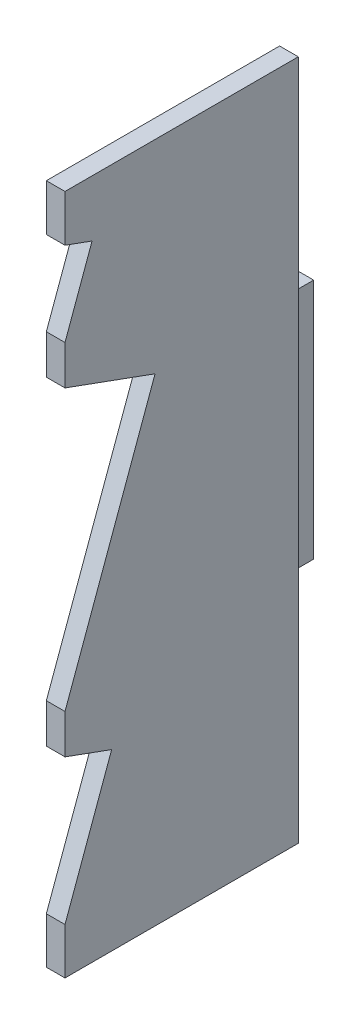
ISO-10303-21;
HEADER;
FILE_DESCRIPTION(('STEP AP214'),'2;1');
FILE_NAME('part.step','',(''),(''),'','','');
FILE_SCHEMA(('AUTOMOTIVE_DESIGN { 1 0 10303 214 1 1 1 1 }'));
ENDSEC;
DATA;
#1=APPLICATION_CONTEXT('core data for automotive mechanical design processes');
#2=APPLICATION_PROTOCOL_DEFINITION('international standard','automotive_design',2000,#1);
#3=PRODUCT_CONTEXT('',#1,'mechanical');
#4=PRODUCT('Part','Part','',(#3));
#5=PRODUCT_RELATED_PRODUCT_CATEGORY('part','',(#4));
#6=PRODUCT_DEFINITION_FORMATION('','',#4);
#7=PRODUCT_DEFINITION_CONTEXT('part definition',#1,'design');
#8=PRODUCT_DEFINITION('design','',#6,#7);
#9=PRODUCT_DEFINITION_SHAPE('','',#8);
#10=(LENGTH_UNIT() NAMED_UNIT(*) SI_UNIT(.MILLI.,.METRE.));
#11=(NAMED_UNIT(*) PLANE_ANGLE_UNIT() SI_UNIT($,.RADIAN.));
#12=(NAMED_UNIT(*) SI_UNIT($,.STERADIAN.) SOLID_ANGLE_UNIT());
#13=UNCERTAINTY_MEASURE_WITH_UNIT(LENGTH_MEASURE(1.E-05),#10,'distance_accuracy_value','');
#14=(GEOMETRIC_REPRESENTATION_CONTEXT(3) GLOBAL_UNCERTAINTY_ASSIGNED_CONTEXT((#13)) GLOBAL_UNIT_ASSIGNED_CONTEXT((#10,
#11,#12)) REPRESENTATION_CONTEXT('',''));
#15=CARTESIAN_POINT('',(0.,0.,0.));
#16=DIRECTION('',(0.,0.,1.));
#17=DIRECTION('',(1.,0.,0.));
#18=AXIS2_PLACEMENT_3D('',#15,#16,#17);
#19=CARTESIAN_POINT('',(0.,-22.9617904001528,74.7231954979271));
#20=DIRECTION('',(-1.,0.,0.));
#21=DIRECTION('',(0.,1.,0.));
#22=AXIS2_PLACEMENT_3D('',#19,#20,#21);
#23=PLANE('',#22);
#24=DIRECTION('',(0.,1.,0.));
#25=VECTOR('',#24,1.);
#26=CARTESIAN_POINT('',(0.,35.,7.69999999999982));
#27=LINE('',#26,#25);
#28=CARTESIAN_POINT('',(0.,-35.,7.69999999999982));
#29=VERTEX_POINT('',#28);
#30=CARTESIAN_POINT('',(0.,35.,7.69999999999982));
#31=VERTEX_POINT('',#30);
#32=EDGE_CURVE('E174',#29,#31,#27,.T.);
#33=ORIENTED_EDGE('',*,*,#32,.F.);
#34=DIRECTION('',(0.,0.,1.));
#35=VECTOR('',#34,1.);
#36=CARTESIAN_POINT('',(0.,-35.,7.69999999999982));
#37=LINE('',#36,#35);
#38=CARTESIAN_POINT('',(0.,-34.9999999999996,0.));
#39=VERTEX_POINT('',#38);
#40=EDGE_CURVE('E189',#39,#29,#37,.T.);
#41=ORIENTED_EDGE('',*,*,#40,.F.);
#42=DIRECTION('',(0.,-1.,0.));
#43=VECTOR('',#42,1.);
#44=CARTESIAN_POINT('',(0.,73.,0.));
#45=LINE('',#44,#43);
#46=CARTESIAN_POINT('',(0.,-73.,0.));
#47=VERTEX_POINT('',#46);
#48=EDGE_CURVE('E238',#39,#47,#45,.T.);
#49=ORIENTED_EDGE('',*,*,#48,.T.);
#50=DIRECTION('',(0.,0.,1.));
#51=VECTOR('',#50,1.);
#52=CARTESIAN_POINT('',(0.,-73.,0.));
#53=LINE('',#52,#51);
#54=CARTESIAN_POINT('',(0.,-73.,50.));
#55=VERTEX_POINT('',#54);
#56=EDGE_CURVE('E241',#47,#55,#53,.T.);
#57=ORIENTED_EDGE('',*,*,#56,.T.);
#58=DIRECTION('',(0.,1.,0.));
#59=VECTOR('',#58,1.);
#60=CARTESIAN_POINT('',(0.,-73.,50.));
#61=LINE('',#60,#59);
#62=CARTESIAN_POINT('',(0.,-63.0747741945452,50.));
#63=VERTEX_POINT('',#62);
#64=EDGE_CURVE('E278',#55,#63,#61,.T.);
#65=ORIENTED_EDGE('',*,*,#64,.T.);
#66=DIRECTION('',(0.,0.9396926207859,-0.342020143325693));
#67=VECTOR('',#66,1.);
#68=CARTESIAN_POINT('',(0.,-35.6,40.));
#69=LINE('',#68,#67);
#70=CARTESIAN_POINT('',(0.,-35.6,40.));
#71=VERTEX_POINT('',#70);
#72=EDGE_CURVE('E279',#63,#71,#69,.T.);
#73=ORIENTED_EDGE('',*,*,#72,.T.);
#74=DIRECTION('',(0.,0.342020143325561,0.939692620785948));
#75=VECTOR('',#74,1.);
#76=CARTESIAN_POINT('',(0.,-35.6,40.));
#77=LINE('',#76,#75);
#78=CARTESIAN_POINT('',(0.,-31.9602976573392,50.));
#79=VERTEX_POINT('',#78);
#80=EDGE_CURVE('E205',#71,#79,#77,.T.);
#81=ORIENTED_EDGE('',*,*,#80,.T.);
#82=DIRECTION('',(0.,1.,0.));
#83=VECTOR('',#82,1.);
#84=CARTESIAN_POINT('',(0.,-31.9602976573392,50.));
#85=LINE('',#84,#83);
#86=CARTESIAN_POINT('',(0.,-23.526314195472,50.));
#87=VERTEX_POINT('',#86);
#88=EDGE_CURVE('E215',#79,#87,#85,.T.);
#89=ORIENTED_EDGE('',*,*,#88,.T.);
#90=DIRECTION('',(0.,0.939692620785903,-0.342020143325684));
#91=VECTOR('',#90,1.);
#92=CARTESIAN_POINT('',(0.,29.5,30.7));
#93=LINE('',#92,#91);
#94=CARTESIAN_POINT('',(0.,29.5,30.7));
#95=VERTEX_POINT('',#94);
#96=EDGE_CURVE('E218',#87,#95,#93,.T.);
#97=ORIENTED_EDGE('',*,*,#96,.T.);
#98=DIRECTION('',(0.,0.342020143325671,0.939692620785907));
#99=VECTOR('',#98,1.);
#100=CARTESIAN_POINT('',(0.,29.5,30.7));
#101=LINE('',#100,#99);
#102=CARTESIAN_POINT('',(0.,36.5246255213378,50.));
#103=VERTEX_POINT('',#102);
#104=EDGE_CURVE('E221',#95,#103,#101,.T.);
#105=ORIENTED_EDGE('',*,*,#104,.T.);
#106=DIRECTION('',(0.,1.,0.));
#107=VECTOR('',#106,1.);
#108=CARTESIAN_POINT('',(0.,36.5246255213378,50.));
#109=LINE('',#108,#107);
#110=CARTESIAN_POINT('',(0.,44.9646309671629,50.));
#111=VERTEX_POINT('',#110);
#112=EDGE_CURVE('E224',#103,#111,#109,.T.);
#113=ORIENTED_EDGE('',*,*,#112,.T.);
#114=DIRECTION('',(0.,0.939692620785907,-0.342020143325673));
#115=VECTOR('',#114,1.);
#116=CARTESIAN_POINT('',(0.,60.9,44.2));
#117=LINE('',#116,#115);
#118=CARTESIAN_POINT('',(0.,60.9,44.2));
#119=VERTEX_POINT('',#118);
#120=EDGE_CURVE('E227',#111,#119,#117,.T.);
#121=ORIENTED_EDGE('',*,*,#120,.T.);
#122=DIRECTION('',(0.,0.342020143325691,0.9396926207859));
#123=VECTOR('',#122,1.);
#124=CARTESIAN_POINT('',(0.,60.9,44.2));
#125=LINE('',#124,#123);
#126=CARTESIAN_POINT('',(0.,63.0110273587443,50.));
#127=VERTEX_POINT('',#126);
#128=EDGE_CURVE('E230',#119,#127,#125,.T.);
#129=ORIENTED_EDGE('',*,*,#128,.T.);
#130=DIRECTION('',(0.,1.,0.));
#131=VECTOR('',#130,1.);
#132=CARTESIAN_POINT('',(0.,63.0110273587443,50.));
#133=LINE('',#132,#131);
#134=CARTESIAN_POINT('',(0.,73.,50.));
#135=VERTEX_POINT('',#134);
#136=EDGE_CURVE('E233',#127,#135,#133,.T.);
#137=ORIENTED_EDGE('',*,*,#136,.T.);
#138=DIRECTION('',(0.,0.,-1.));
#139=VECTOR('',#138,1.);
#140=CARTESIAN_POINT('',(0.,73.,50.));
#141=LINE('',#140,#139);
#142=CARTESIAN_POINT('',(0.,73.,0.));
#143=VERTEX_POINT('',#142);
#144=EDGE_CURVE('E236',#135,#143,#141,.T.);
#145=ORIENTED_EDGE('',*,*,#144,.T.);
#146=CARTESIAN_POINT('',(0.,35.,0.));
#147=VERTEX_POINT('',#146);
#148=EDGE_CURVE('E177',#143,#147,#45,.T.);
#149=ORIENTED_EDGE('',*,*,#148,.T.);
#150=DIRECTION('',(0.,0.,-1.));
#151=VECTOR('',#150,1.);
#152=CARTESIAN_POINT('',(0.,35.,0.));
#153=LINE('',#152,#151);
#154=EDGE_CURVE('E18',#31,#147,#153,.T.);
#155=ORIENTED_EDGE('',*,*,#154,.F.);
#156=EDGE_LOOP('',(#33,#41,#49,#57,#65,#73,#81,#89,#97,#105,#113,#121,#129,#137,#145,#149,#155));
#157=FACE_BOUND('',#156,.T.);
#158=ADVANCED_FACE('F14',(#157),#23,.T.);
#159=CARTESIAN_POINT('',(4.,-35.6,40.));
#160=DIRECTION('',(0.,0.939692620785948,-0.342020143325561));
#161=DIRECTION('',(0.,-0.342020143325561,-0.939692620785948));
#162=AXIS2_PLACEMENT_3D('',#159,#160,#161);
#163=PLANE('',#162);
#164=ORIENTED_EDGE('',*,*,#80,.F.);
#165=DIRECTION('',(-1.,0.,0.));
#166=VECTOR('',#165,1.);
#167=CARTESIAN_POINT('',(4.,-35.6,40.));
#168=LINE('',#167,#166);
#169=CARTESIAN_POINT('',(4.,-35.6,40.));
#170=VERTEX_POINT('',#169);
#171=EDGE_CURVE('E317',#170,#71,#168,.T.);
#172=ORIENTED_EDGE('',*,*,#171,.F.);
#173=DIRECTION('',(0.,0.342020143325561,0.939692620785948));
#174=VECTOR('',#173,1.);
#175=CARTESIAN_POINT('',(4.,-35.6,40.));
#176=LINE('',#175,#174);
#177=CARTESIAN_POINT('',(4.,-31.9602976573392,50.));
#178=VERTEX_POINT('',#177);
#179=EDGE_CURVE('E281',#170,#178,#176,.T.);
#180=ORIENTED_EDGE('',*,*,#179,.T.);
#181=DIRECTION('',(-1.,0.,0.));
#182=VECTOR('',#181,1.);
#183=CARTESIAN_POINT('',(4.,-31.9602976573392,50.));
#184=LINE('',#183,#182);
#185=EDGE_CURVE('E9',#178,#79,#184,.T.);
#186=ORIENTED_EDGE('',*,*,#185,.T.);
#187=EDGE_LOOP('',(#164,#172,#180,#186));
#188=FACE_BOUND('',#187,.T.);
#189=ADVANCED_FACE('F16',(#188),#163,.F.);
#190=CARTESIAN_POINT('',(4.,-31.9602976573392,50.));
#191=DIRECTION('',(0.,0.,-1.));
#192=DIRECTION('',(-1.,0.,0.));
#193=AXIS2_PLACEMENT_3D('',#190,#191,#192);
#194=PLANE('',#193);
#195=ORIENTED_EDGE('',*,*,#88,.F.);
#196=ORIENTED_EDGE('',*,*,#185,.F.);
#197=DIRECTION('',(0.,1.,0.));
#198=VECTOR('',#197,1.);
#199=CARTESIAN_POINT('',(4.,-31.9602976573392,50.));
#200=LINE('',#199,#198);
#201=CARTESIAN_POINT('',(4.,-23.526314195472,50.));
#202=VERTEX_POINT('',#201);
#203=EDGE_CURVE('E286',#178,#202,#200,.T.);
#204=ORIENTED_EDGE('',*,*,#203,.T.);
#205=DIRECTION('',(-1.,0.,0.));
#206=VECTOR('',#205,1.);
#207=CARTESIAN_POINT('',(4.,-23.526314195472,50.));
#208=LINE('',#207,#206);
#209=EDGE_CURVE('E24',#202,#87,#208,.T.);
#210=ORIENTED_EDGE('',*,*,#209,.T.);
#211=EDGE_LOOP('',(#195,#196,#204,#210));
#212=FACE_BOUND('',#211,.T.);
#213=ADVANCED_FACE('F338',(#212),#194,.F.);
#214=CARTESIAN_POINT('',(4.,29.5,30.7));
#215=DIRECTION('',(0.,-0.342020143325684,-0.939692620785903));
#216=DIRECTION('',(0.,-0.939692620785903,0.342020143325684));
#217=AXIS2_PLACEMENT_3D('',#214,#215,#216);
#218=PLANE('',#217);
#219=ORIENTED_EDGE('',*,*,#96,.F.);
#220=ORIENTED_EDGE('',*,*,#209,.F.);
#221=DIRECTION('',(0.,0.939692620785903,-0.342020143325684));
#222=VECTOR('',#221,1.);
#223=CARTESIAN_POINT('',(4.,29.5,30.7));
#224=LINE('',#223,#222);
#225=CARTESIAN_POINT('',(4.,29.5,30.7));
#226=VERTEX_POINT('',#225);
#227=EDGE_CURVE('E289',#202,#226,#224,.T.);
#228=ORIENTED_EDGE('',*,*,#227,.T.);
#229=DIRECTION('',(-1.,0.,0.));
#230=VECTOR('',#229,1.);
#231=CARTESIAN_POINT('',(4.,29.5,30.7));
#232=LINE('',#231,#230);
#233=EDGE_CURVE('E333',#226,#95,#232,.T.);
#234=ORIENTED_EDGE('',*,*,#233,.T.);
#235=EDGE_LOOP('',(#219,#220,#228,#234));
#236=FACE_BOUND('',#235,.T.);
#237=ADVANCED_FACE('F341',(#236),#218,.F.);
#238=CARTESIAN_POINT('',(4.,29.5,30.7));
#239=DIRECTION('',(0.,0.939692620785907,-0.342020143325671));
#240=DIRECTION('',(0.,-0.342020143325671,-0.939692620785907));
#241=AXIS2_PLACEMENT_3D('',#238,#239,#240);
#242=PLANE('',#241);
#243=ORIENTED_EDGE('',*,*,#104,.F.);
#244=ORIENTED_EDGE('',*,*,#233,.F.);
#245=DIRECTION('',(0.,0.342020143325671,0.939692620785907));
#246=VECTOR('',#245,1.);
#247=CARTESIAN_POINT('',(4.,29.5,30.7));
#248=LINE('',#247,#246);
#249=CARTESIAN_POINT('',(4.,36.5246255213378,50.));
#250=VERTEX_POINT('',#249);
#251=EDGE_CURVE('E292',#226,#250,#248,.T.);
#252=ORIENTED_EDGE('',*,*,#251,.T.);
#253=DIRECTION('',(-1.,0.,0.));
#254=VECTOR('',#253,1.);
#255=CARTESIAN_POINT('',(4.,36.5246255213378,50.));
#256=LINE('',#255,#254);
#257=EDGE_CURVE('E331',#250,#103,#256,.T.);
#258=ORIENTED_EDGE('',*,*,#257,.T.);
#259=EDGE_LOOP('',(#243,#244,#252,#258));
#260=FACE_BOUND('',#259,.T.);
#261=ADVANCED_FACE('F352',(#260),#242,.F.);
#262=CARTESIAN_POINT('',(4.,36.5246255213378,50.));
#263=DIRECTION('',(0.,0.,-1.));
#264=DIRECTION('',(-1.,0.,0.));
#265=AXIS2_PLACEMENT_3D('',#262,#263,#264);
#266=PLANE('',#265);
#267=ORIENTED_EDGE('',*,*,#112,.F.);
#268=ORIENTED_EDGE('',*,*,#257,.F.);
#269=DIRECTION('',(0.,1.,0.));
#270=VECTOR('',#269,1.);
#271=CARTESIAN_POINT('',(4.,36.5246255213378,50.));
#272=LINE('',#271,#270);
#273=CARTESIAN_POINT('',(4.,44.9646309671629,50.));
#274=VERTEX_POINT('',#273);
#275=EDGE_CURVE('E295',#250,#274,#272,.T.);
#276=ORIENTED_EDGE('',*,*,#275,.T.);
#277=DIRECTION('',(-1.,0.,0.));
#278=VECTOR('',#277,1.);
#279=CARTESIAN_POINT('',(4.,44.9646309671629,50.));
#280=LINE('',#279,#278);
#281=EDGE_CURVE('E329',#274,#111,#280,.T.);
#282=ORIENTED_EDGE('',*,*,#281,.T.);
#283=EDGE_LOOP('',(#267,#268,#276,#282));
#284=FACE_BOUND('',#283,.T.);
#285=ADVANCED_FACE('F356',(#284),#266,.F.);
#286=CARTESIAN_POINT('',(4.,60.9,44.2));
#287=DIRECTION('',(0.,-0.342020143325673,-0.939692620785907));
#288=DIRECTION('',(0.,-0.939692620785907,0.342020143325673));
#289=AXIS2_PLACEMENT_3D('',#286,#287,#288);
#290=PLANE('',#289);
#291=ORIENTED_EDGE('',*,*,#120,.F.);
#292=ORIENTED_EDGE('',*,*,#281,.F.);
#293=DIRECTION('',(0.,0.939692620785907,-0.342020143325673));
#294=VECTOR('',#293,1.);
#295=CARTESIAN_POINT('',(4.,60.9,44.2));
#296=LINE('',#295,#294);
#297=CARTESIAN_POINT('',(4.,60.9,44.2));
#298=VERTEX_POINT('',#297);
#299=EDGE_CURVE('E298',#274,#298,#296,.T.);
#300=ORIENTED_EDGE('',*,*,#299,.T.);
#301=DIRECTION('',(-1.,0.,0.));
#302=VECTOR('',#301,1.);
#303=CARTESIAN_POINT('',(4.,60.9,44.2));
#304=LINE('',#303,#302);
#305=EDGE_CURVE('E327',#298,#119,#304,.T.);
#306=ORIENTED_EDGE('',*,*,#305,.T.);
#307=EDGE_LOOP('',(#291,#292,#300,#306));
#308=FACE_BOUND('',#307,.T.);
#309=ADVANCED_FACE('F359',(#308),#290,.F.);
#310=CARTESIAN_POINT('',(4.,60.9,44.2));
#311=DIRECTION('',(0.,0.9396926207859,-0.342020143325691));
#312=DIRECTION('',(0.,-0.342020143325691,-0.9396926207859));
#313=AXIS2_PLACEMENT_3D('',#310,#311,#312);
#314=PLANE('',#313);
#315=ORIENTED_EDGE('',*,*,#128,.F.);
#316=ORIENTED_EDGE('',*,*,#305,.F.);
#317=DIRECTION('',(0.,0.342020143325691,0.9396926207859));
#318=VECTOR('',#317,1.);
#319=CARTESIAN_POINT('',(4.,60.9,44.2));
#320=LINE('',#319,#318);
#321=CARTESIAN_POINT('',(4.,63.0110273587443,50.));
#322=VERTEX_POINT('',#321);
#323=EDGE_CURVE('E301',#298,#322,#320,.T.);
#324=ORIENTED_EDGE('',*,*,#323,.T.);
#325=DIRECTION('',(-1.,0.,0.));
#326=VECTOR('',#325,1.);
#327=CARTESIAN_POINT('',(4.,63.0110273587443,50.));
#328=LINE('',#327,#326);
#329=EDGE_CURVE('E325',#322,#127,#328,.T.);
#330=ORIENTED_EDGE('',*,*,#329,.T.);
#331=EDGE_LOOP('',(#315,#316,#324,#330));
#332=FACE_BOUND('',#331,.T.);
#333=ADVANCED_FACE('F363',(#332),#314,.F.);
#334=CARTESIAN_POINT('',(4.,63.0110273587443,50.));
#335=DIRECTION('',(0.,0.,-1.));
#336=DIRECTION('',(-1.,0.,0.));
#337=AXIS2_PLACEMENT_3D('',#334,#335,#336);
#338=PLANE('',#337);
#339=ORIENTED_EDGE('',*,*,#136,.F.);
#340=ORIENTED_EDGE('',*,*,#329,.F.);
#341=DIRECTION('',(0.,1.,0.));
#342=VECTOR('',#341,1.);
#343=CARTESIAN_POINT('',(4.,63.0110273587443,50.));
#344=LINE('',#343,#342);
#345=CARTESIAN_POINT('',(4.,73.,50.));
#346=VERTEX_POINT('',#345);
#347=EDGE_CURVE('E304',#322,#346,#344,.T.);
#348=ORIENTED_EDGE('',*,*,#347,.T.);
#349=DIRECTION('',(-1.,0.,0.));
#350=VECTOR('',#349,1.);
#351=CARTESIAN_POINT('',(4.,73.,50.));
#352=LINE('',#351,#350);
#353=EDGE_CURVE('E323',#346,#135,#352,.T.);
#354=ORIENTED_EDGE('',*,*,#353,.T.);
#355=EDGE_LOOP('',(#339,#340,#348,#354));
#356=FACE_BOUND('',#355,.T.);
#357=ADVANCED_FACE('F368',(#356),#338,.F.);
#358=CARTESIAN_POINT('',(4.,73.,50.));
#359=DIRECTION('',(0.,-1.,0.));
#360=DIRECTION('',(-1.,0.,0.));
#361=AXIS2_PLACEMENT_3D('',#358,#359,#360);
#362=PLANE('',#361);
#363=ORIENTED_EDGE('',*,*,#144,.F.);
#364=ORIENTED_EDGE('',*,*,#353,.F.);
#365=DIRECTION('',(0.,0.,-1.));
#366=VECTOR('',#365,1.);
#367=CARTESIAN_POINT('',(4.,73.,50.));
#368=LINE('',#367,#366);
#369=CARTESIAN_POINT('',(4.,73.,0.));
#370=VERTEX_POINT('',#369);
#371=EDGE_CURVE('E307',#346,#370,#368,.T.);
#372=ORIENTED_EDGE('',*,*,#371,.T.);
#373=DIRECTION('',(-1.,0.,0.));
#374=VECTOR('',#373,1.);
#375=CARTESIAN_POINT('',(4.,73.,0.));
#376=LINE('',#375,#374);
#377=EDGE_CURVE('E272',#370,#143,#376,.T.);
#378=ORIENTED_EDGE('',*,*,#377,.T.);
#379=EDGE_LOOP('',(#363,#364,#372,#378));
#380=FACE_BOUND('',#379,.T.);
#381=ADVANCED_FACE('F371',(#380),#362,.F.);
#382=CARTESIAN_POINT('',(4.,73.,0.));
#383=DIRECTION('',(0.,0.,1.));
#384=DIRECTION('',(1.,0.,0.));
#385=AXIS2_PLACEMENT_3D('',#382,#383,#384);
#386=PLANE('',#385);
#387=ORIENTED_EDGE('',*,*,#148,.F.);
#388=ORIENTED_EDGE('',*,*,#377,.F.);
#389=DIRECTION('',(0.,-1.,0.));
#390=VECTOR('',#389,1.);
#391=CARTESIAN_POINT('',(4.,73.,0.));
#392=LINE('',#391,#390);
#393=CARTESIAN_POINT('',(4.,-73.,0.));
#394=VERTEX_POINT('',#393);
#395=EDGE_CURVE('E269',#370,#394,#392,.T.);
#396=ORIENTED_EDGE('',*,*,#395,.T.);
#397=DIRECTION('',(-1.,0.,0.));
#398=VECTOR('',#397,1.);
#399=CARTESIAN_POINT('',(4.,-73.,0.));
#400=LINE('',#399,#398);
#401=EDGE_CURVE('E267',#394,#47,#400,.T.);
#402=ORIENTED_EDGE('',*,*,#401,.T.);
#403=ORIENTED_EDGE('',*,*,#48,.F.);
#404=DIRECTION('',(1.,0.,0.));
#405=VECTOR('',#404,1.);
#406=CARTESIAN_POINT('',(-6.,-34.9999999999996,0.));
#407=LINE('',#406,#405);
#408=CARTESIAN_POINT('',(-6.,-34.9999999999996,0.));
#409=VERTEX_POINT('',#408);
#410=EDGE_CURVE('E206',#409,#39,#407,.T.);
#411=ORIENTED_EDGE('',*,*,#410,.F.);
#412=DIRECTION('',(0.,-1.,0.));
#413=VECTOR('',#412,1.);
#414=CARTESIAN_POINT('',(-6.,-25.9,0.));
#415=LINE('',#414,#413);
#416=CARTESIAN_POINT('',(-6.,-25.9,0.));
#417=VERTEX_POINT('',#416);
#418=EDGE_CURVE('E200',#417,#409,#415,.T.);
#419=ORIENTED_EDGE('',*,*,#418,.F.);
#420=DIRECTION('',(1.,0.,0.));
#421=VECTOR('',#420,1.);
#422=CARTESIAN_POINT('',(-6.,-25.9,0.));
#423=LINE('',#422,#421);
#424=CARTESIAN_POINT('',(0.,-25.9,0.));
#425=VERTEX_POINT('',#424);
#426=EDGE_CURVE('E209',#417,#425,#423,.T.);
#427=ORIENTED_EDGE('',*,*,#426,.T.);
#428=CARTESIAN_POINT('',(0.,25.9,0.));
#429=VERTEX_POINT('',#428);
#430=EDGE_CURVE('E249',#429,#425,#45,.T.);
#431=ORIENTED_EDGE('',*,*,#430,.F.);
#432=DIRECTION('',(1.,0.,0.));
#433=VECTOR('',#432,1.);
#434=CARTESIAN_POINT('',(-6.,25.9,0.));
#435=LINE('',#434,#433);
#436=CARTESIAN_POINT('',(-6.,25.9,0.));
#437=VERTEX_POINT('',#436);
#438=EDGE_CURVE('E211',#437,#429,#435,.T.);
#439=ORIENTED_EDGE('',*,*,#438,.F.);
#440=DIRECTION('',(0.,-1.,0.));
#441=VECTOR('',#440,1.);
#442=CARTESIAN_POINT('',(-6.,35.,0.));
#443=LINE('',#442,#441);
#444=CARTESIAN_POINT('',(-6.,35.,0.));
#445=VERTEX_POINT('',#444);
#446=EDGE_CURVE('E191',#445,#437,#443,.T.);
#447=ORIENTED_EDGE('',*,*,#446,.F.);
#448=DIRECTION('',(1.,0.,0.));
#449=VECTOR('',#448,1.);
#450=CARTESIAN_POINT('',(-6.,35.,0.));
#451=LINE('',#450,#449);
#452=EDGE_CURVE('E168',#445,#147,#451,.T.);
#453=ORIENTED_EDGE('',*,*,#452,.T.);
#454=EDGE_LOOP('',(#387,#388,#396,#402,#403,#411,#419,#427,#431,#439,#447,#453));
#455=FACE_BOUND('',#454,.T.);
#456=ADVANCED_FACE('F263',(#455),#386,.F.);
#457=CARTESIAN_POINT('',(4.,-73.,0.));
#458=DIRECTION('',(0.,1.,0.));
#459=DIRECTION('',(1.,0.,0.));
#460=AXIS2_PLACEMENT_3D('',#457,#458,#459);
#461=PLANE('',#460);
#462=ORIENTED_EDGE('',*,*,#56,.F.);
#463=ORIENTED_EDGE('',*,*,#401,.F.);
#464=DIRECTION('',(0.,0.,1.));
#465=VECTOR('',#464,1.);
#466=CARTESIAN_POINT('',(4.,-73.,0.));
#467=LINE('',#466,#465);
#468=CARTESIAN_POINT('',(4.,-73.,50.));
#469=VERTEX_POINT('',#468);
#470=EDGE_CURVE('E311',#394,#469,#467,.T.);
#471=ORIENTED_EDGE('',*,*,#470,.T.);
#472=DIRECTION('',(-1.,0.,0.));
#473=VECTOR('',#472,1.);
#474=CARTESIAN_POINT('',(4.,-73.,50.));
#475=LINE('',#474,#473);
#476=EDGE_CURVE('E273',#469,#55,#475,.T.);
#477=ORIENTED_EDGE('',*,*,#476,.T.);
#478=EDGE_LOOP('',(#462,#463,#471,#477));
#479=FACE_BOUND('',#478,.T.);
#480=ADVANCED_FACE('F275',(#479),#461,.F.);
#481=CARTESIAN_POINT('',(4.,-73.,50.));
#482=DIRECTION('',(0.,0.,-1.));
#483=DIRECTION('',(0.,-1.,0.));
#484=AXIS2_PLACEMENT_3D('',#481,#482,#483);
#485=PLANE('',#484);
#486=ORIENTED_EDGE('',*,*,#64,.F.);
#487=ORIENTED_EDGE('',*,*,#476,.F.);
#488=DIRECTION('',(0.,1.,0.));
#489=VECTOR('',#488,1.);
#490=CARTESIAN_POINT('',(4.,-73.,50.));
#491=LINE('',#490,#489);
#492=CARTESIAN_POINT('',(4.,-63.0747741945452,50.));
#493=VERTEX_POINT('',#492);
#494=EDGE_CURVE('E313',#469,#493,#491,.T.);
#495=ORIENTED_EDGE('',*,*,#494,.T.);
#496=DIRECTION('',(-1.,0.,0.));
#497=VECTOR('',#496,1.);
#498=CARTESIAN_POINT('',(4.,-63.0747741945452,50.));
#499=LINE('',#498,#497);
#500=EDGE_CURVE('E319',#493,#63,#499,.T.);
#501=ORIENTED_EDGE('',*,*,#500,.T.);
#502=EDGE_LOOP('',(#486,#487,#495,#501));
#503=FACE_BOUND('',#502,.T.);
#504=ADVANCED_FACE('F435',(#503),#485,.F.);
#505=CARTESIAN_POINT('',(4.,-35.6,40.));
#506=DIRECTION('',(0.,-0.342020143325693,-0.9396926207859));
#507=DIRECTION('',(0.,-0.9396926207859,0.342020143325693));
#508=AXIS2_PLACEMENT_3D('',#505,#506,#507);
#509=PLANE('',#508);
#510=ORIENTED_EDGE('',*,*,#72,.F.);
#511=ORIENTED_EDGE('',*,*,#500,.F.);
#512=DIRECTION('',(0.,0.9396926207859,-0.342020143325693));
#513=VECTOR('',#512,1.);
#514=CARTESIAN_POINT('',(4.,-35.6,40.));
#515=LINE('',#514,#513);
#516=EDGE_CURVE('E40',#493,#170,#515,.T.);
#517=ORIENTED_EDGE('',*,*,#516,.T.);
#518=ORIENTED_EDGE('',*,*,#171,.T.);
#519=EDGE_LOOP('',(#510,#511,#517,#518));
#520=FACE_BOUND('',#519,.T.);
#521=ADVANCED_FACE('F432',(#520),#509,.F.);
#522=CARTESIAN_POINT('',(4.,-22.9617904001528,74.7231954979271));
#523=DIRECTION('',(-1.,0.,0.));
#524=DIRECTION('',(0.,1.,0.));
#525=AXIS2_PLACEMENT_3D('',#522,#523,#524);
#526=PLANE('',#525);
#527=ORIENTED_EDGE('',*,*,#179,.F.);
#528=ORIENTED_EDGE('',*,*,#516,.F.);
#529=ORIENTED_EDGE('',*,*,#494,.F.);
#530=ORIENTED_EDGE('',*,*,#470,.F.);
#531=ORIENTED_EDGE('',*,*,#395,.F.);
#532=ORIENTED_EDGE('',*,*,#371,.F.);
#533=ORIENTED_EDGE('',*,*,#347,.F.);
#534=ORIENTED_EDGE('',*,*,#323,.F.);
#535=ORIENTED_EDGE('',*,*,#299,.F.);
#536=ORIENTED_EDGE('',*,*,#275,.F.);
#537=ORIENTED_EDGE('',*,*,#251,.F.);
#538=ORIENTED_EDGE('',*,*,#227,.F.);
#539=ORIENTED_EDGE('',*,*,#203,.F.);
#540=EDGE_LOOP('',(#527,#528,#529,#530,#531,#532,#533,#534,#535,#536,#537,#538,#539));
#541=FACE_BOUND('',#540,.T.);
#542=ADVANCED_FACE('F349',(#541),#526,.F.);
#543=CARTESIAN_POINT('',(0.,-25.9,7.69999999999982));
#544=DIRECTION('',(1.,0.,0.));
#545=DIRECTION('',(0.,-1.,0.));
#546=AXIS2_PLACEMENT_3D('',#543,#544,#545);
#547=PLANE('',#546);
#548=ORIENTED_EDGE('',*,*,#430,.T.);
#549=DIRECTION('',(0.,0.,1.));
#550=VECTOR('',#549,1.);
#551=CARTESIAN_POINT('',(0.,-25.9,-7.30000000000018));
#552=LINE('',#551,#550);
#553=CARTESIAN_POINT('',(0.,-25.9,-7.30000000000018));
#554=VERTEX_POINT('',#553);
#555=EDGE_CURVE('E186',#554,#425,#552,.T.);
#556=ORIENTED_EDGE('',*,*,#555,.F.);
#557=DIRECTION('',(0.,-1.,0.));
#558=VECTOR('',#557,1.);
#559=CARTESIAN_POINT('',(0.,25.9,-7.30000000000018));
#560=LINE('',#559,#558);
#561=CARTESIAN_POINT('',(0.,25.9,-7.30000000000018));
#562=VERTEX_POINT('',#561);
#563=EDGE_CURVE('E183',#562,#554,#560,.T.);
#564=ORIENTED_EDGE('',*,*,#563,.F.);
#565=DIRECTION('',(0.,0.,-1.));
#566=VECTOR('',#565,1.);
#567=CARTESIAN_POINT('',(0.,25.9,0.));
#568=LINE('',#567,#566);
#569=EDGE_CURVE('E178',#429,#562,#568,.T.);
#570=ORIENTED_EDGE('',*,*,#569,.F.);
#571=EDGE_LOOP('',(#548,#556,#564,#570));
#572=FACE_BOUND('',#571,.T.);
#573=ADVANCED_FACE('F405',(#572),#547,.T.);
#574=CARTESIAN_POINT('',(-6.,35.,7.69999999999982));
#575=DIRECTION('',(0.,0.,1.));
#576=DIRECTION('',(1.,0.,0.));
#577=AXIS2_PLACEMENT_3D('',#574,#575,#576);
#578=PLANE('',#577);
#579=ORIENTED_EDGE('',*,*,#32,.T.);
#580=DIRECTION('',(1.,0.,0.));
#581=VECTOR('',#580,1.);
#582=CARTESIAN_POINT('',(-6.,35.,7.69999999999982));
#583=LINE('',#582,#581);
#584=CARTESIAN_POINT('',(-6.,35.,7.69999999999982));
#585=VERTEX_POINT('',#584);
#586=EDGE_CURVE('E161',#585,#31,#583,.T.);
#587=ORIENTED_EDGE('',*,*,#586,.F.);
#588=DIRECTION('',(0.,1.,0.));
#589=VECTOR('',#588,1.);
#590=CARTESIAN_POINT('',(-6.,35.,7.69999999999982));
#591=LINE('',#590,#589);
#592=CARTESIAN_POINT('',(-6.,-35.,7.69999999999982));
#593=VERTEX_POINT('',#592);
#594=EDGE_CURVE('E187',#593,#585,#591,.T.);
#595=ORIENTED_EDGE('',*,*,#594,.F.);
#596=DIRECTION('',(1.,0.,0.));
#597=VECTOR('',#596,1.);
#598=CARTESIAN_POINT('',(-6.,-35.,7.69999999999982));
#599=LINE('',#598,#597);
#600=EDGE_CURVE('E32',#593,#29,#599,.T.);
#601=ORIENTED_EDGE('',*,*,#600,.T.);
#602=EDGE_LOOP('',(#579,#587,#595,#601));
#603=FACE_BOUND('',#602,.T.);
#604=ADVANCED_FACE('F179',(#603),#578,.T.);
#605=CARTESIAN_POINT('',(-6.,-35.,7.69999999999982));
#606=DIRECTION('',(0.,-1.,0.));
#607=DIRECTION('',(0.,0.,1.));
#608=AXIS2_PLACEMENT_3D('',#605,#606,#607);
#609=PLANE('',#608);
#610=ORIENTED_EDGE('',*,*,#40,.T.);
#611=ORIENTED_EDGE('',*,*,#600,.F.);
#612=DIRECTION('',(0.,0.,1.));
#613=VECTOR('',#612,1.);
#614=CARTESIAN_POINT('',(-6.,-35.,7.69999999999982));
#615=LINE('',#614,#613);
#616=EDGE_CURVE('E169',#409,#593,#615,.T.);
#617=ORIENTED_EDGE('',*,*,#616,.F.);
#618=ORIENTED_EDGE('',*,*,#410,.T.);
#619=EDGE_LOOP('',(#610,#611,#617,#618));
#620=FACE_BOUND('',#619,.T.);
#621=ADVANCED_FACE('F396',(#620),#609,.T.);
#622=CARTESIAN_POINT('',(-6.,-25.9,-7.30000000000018));
#623=DIRECTION('',(0.,-1.,0.));
#624=DIRECTION('',(-1.,0.,0.));
#625=AXIS2_PLACEMENT_3D('',#622,#623,#624);
#626=PLANE('',#625);
#627=ORIENTED_EDGE('',*,*,#555,.T.);
#628=ORIENTED_EDGE('',*,*,#426,.F.);
#629=DIRECTION('',(0.,0.,1.));
#630=VECTOR('',#629,1.);
#631=CARTESIAN_POINT('',(-6.,-25.9,-7.30000000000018));
#632=LINE('',#631,#630);
#633=CARTESIAN_POINT('',(-6.,-25.9,-7.30000000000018));
#634=VERTEX_POINT('',#633);
#635=EDGE_CURVE('E198',#634,#417,#632,.T.);
#636=ORIENTED_EDGE('',*,*,#635,.F.);
#637=DIRECTION('',(1.,0.,0.));
#638=VECTOR('',#637,1.);
#639=CARTESIAN_POINT('',(-6.,-25.9,-7.30000000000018));
#640=LINE('',#639,#638);
#641=EDGE_CURVE('E207',#634,#554,#640,.T.);
#642=ORIENTED_EDGE('',*,*,#641,.T.);
#643=EDGE_LOOP('',(#627,#628,#636,#642));
#644=FACE_BOUND('',#643,.T.);
#645=ADVANCED_FACE('F402',(#644),#626,.T.);
#646=CARTESIAN_POINT('',(-6.,25.9,-7.30000000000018));
#647=DIRECTION('',(0.,0.,-1.));
#648=DIRECTION('',(-1.,0.,0.));
#649=AXIS2_PLACEMENT_3D('',#646,#647,#648);
#650=PLANE('',#649);
#651=ORIENTED_EDGE('',*,*,#563,.T.);
#652=ORIENTED_EDGE('',*,*,#641,.F.);
#653=DIRECTION('',(0.,-1.,0.));
#654=VECTOR('',#653,1.);
#655=CARTESIAN_POINT('',(-6.,25.9,-7.30000000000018));
#656=LINE('',#655,#654);
#657=CARTESIAN_POINT('',(-6.,25.9,-7.30000000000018));
#658=VERTEX_POINT('',#657);
#659=EDGE_CURVE('E196',#658,#634,#656,.T.);
#660=ORIENTED_EDGE('',*,*,#659,.F.);
#661=DIRECTION('',(1.,0.,0.));
#662=VECTOR('',#661,1.);
#663=CARTESIAN_POINT('',(-6.,25.9,-7.30000000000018));
#664=LINE('',#663,#662);
#665=EDGE_CURVE('E210',#658,#562,#664,.T.);
#666=ORIENTED_EDGE('',*,*,#665,.T.);
#667=EDGE_LOOP('',(#651,#652,#660,#666));
#668=FACE_BOUND('',#667,.T.);
#669=ADVANCED_FACE('F407',(#668),#650,.T.);
#670=CARTESIAN_POINT('',(-6.,25.9,0.));
#671=DIRECTION('',(0.,1.,0.));
#672=DIRECTION('',(1.,0.,0.));
#673=AXIS2_PLACEMENT_3D('',#670,#671,#672);
#674=PLANE('',#673);
#675=ORIENTED_EDGE('',*,*,#569,.T.);
#676=ORIENTED_EDGE('',*,*,#665,.F.);
#677=DIRECTION('',(0.,0.,-1.));
#678=VECTOR('',#677,1.);
#679=CARTESIAN_POINT('',(-6.,25.9,0.));
#680=LINE('',#679,#678);
#681=EDGE_CURVE('E194',#437,#658,#680,.T.);
#682=ORIENTED_EDGE('',*,*,#681,.F.);
#683=ORIENTED_EDGE('',*,*,#438,.T.);
#684=EDGE_LOOP('',(#675,#676,#682,#683));
#685=FACE_BOUND('',#684,.T.);
#686=ADVANCED_FACE('F411',(#685),#674,.T.);
#687=CARTESIAN_POINT('',(-6.,35.,0.));
#688=DIRECTION('',(0.,1.,0.));
#689=DIRECTION('',(1.,0.,0.));
#690=AXIS2_PLACEMENT_3D('',#687,#688,#689);
#691=PLANE('',#690);
#692=ORIENTED_EDGE('',*,*,#154,.T.);
#693=ORIENTED_EDGE('',*,*,#452,.F.);
#694=DIRECTION('',(0.,0.,-1.));
#695=VECTOR('',#694,1.);
#696=CARTESIAN_POINT('',(-6.,35.,0.));
#697=LINE('',#696,#695);
#698=EDGE_CURVE('E166',#585,#445,#697,.T.);
#699=ORIENTED_EDGE('',*,*,#698,.F.);
#700=ORIENTED_EDGE('',*,*,#586,.T.);
#701=EDGE_LOOP('',(#692,#693,#699,#700));
#702=FACE_BOUND('',#701,.T.);
#703=ADVANCED_FACE('F163',(#702),#691,.T.);
#704=CARTESIAN_POINT('',(-6.,-25.9,7.69999999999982));
#705=DIRECTION('',(1.,0.,0.));
#706=DIRECTION('',(0.,-1.,0.));
#707=AXIS2_PLACEMENT_3D('',#704,#705,#706);
#708=PLANE('',#707);
#709=ORIENTED_EDGE('',*,*,#594,.T.);
#710=ORIENTED_EDGE('',*,*,#698,.T.);
#711=ORIENTED_EDGE('',*,*,#446,.T.);
#712=ORIENTED_EDGE('',*,*,#681,.T.);
#713=ORIENTED_EDGE('',*,*,#659,.T.);
#714=ORIENTED_EDGE('',*,*,#635,.T.);
#715=ORIENTED_EDGE('',*,*,#418,.T.);
#716=ORIENTED_EDGE('',*,*,#616,.T.);
#717=EDGE_LOOP('',(#709,#710,#711,#712,#713,#714,#715,#716));
#718=FACE_BOUND('',#717,.T.);
#719=ADVANCED_FACE('F398',(#718),#708,.F.);
#720=CLOSED_SHELL('',(#158,#189,#213,#237,#261,#285,#309,#333,#357,#381,#456,#480,#504,#521,
#542,#573,#604,#621,#645,#669,#686,#703,#719));
#721=MANIFOLD_SOLID_BREP('B1',#720);
#722=ADVANCED_BREP_SHAPE_REPRESENTATION('',(#18,#721),#14);
#723=SHAPE_DEFINITION_REPRESENTATION(#9,#722);
ENDSEC;
END-ISO-10303-21;
